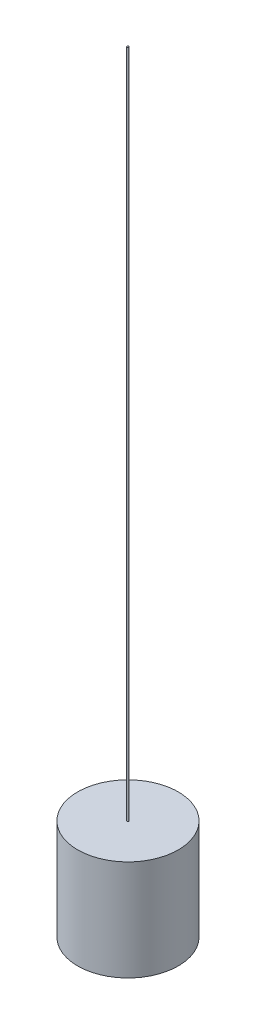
from build123d import *

# Parameters (mm, degrees)
SKETCH2_R           = 7.5
BOSS_EXTRUDE1_DEPTH = 15
SKETCH3_R           = 0.131315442
BOSS_EXTRUDE2_DEPTH = 100


with BuildPart() as part:
    # Sketch2 → Boss-Extrude1 (new body)
    with BuildSketch(Plane(origin=(0, 0, 0), x_dir=(1, 0, 0), z_dir=(0, 1, 0))):
        with Locations(Location((0, 0, 0), (0, 0, 270))):
            Circle(SKETCH2_R)
    extrude(amount=BOSS_EXTRUDE1_DEPTH)

    # Sketch3 → Boss-Extrude2 (add)
    with BuildSketch(Plane(origin=(0, 15, 0), x_dir=(1, 0, 0), z_dir=(0, 1, 0))):
        with Locations(Location((0, 0, 0), (0, 0, 270))):
            Circle(SKETCH3_R)
    extrude(amount=BOSS_EXTRUDE2_DEPTH)


solid = part.part
